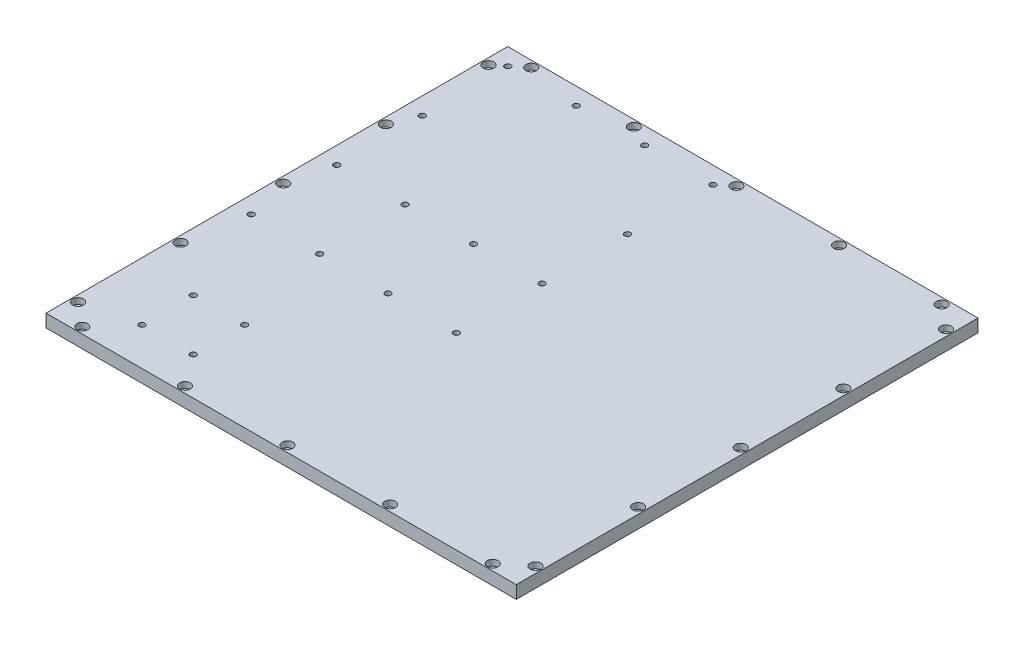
from build123d import *

# Parameters (mm, degrees)
SKETCH1_W                                           = 349.25
SKETCH1_H                                           = 342.9
BOSS_EXTRUDE1_DEPTH                                 = 9.525
CBORE_FOR_8_BINDING_HEAD_MACHINE_SCREW1_D           = 4.3053
CBORE_FOR_8_BINDING_HEAD_MACHINE_SCREW1_CBORE_D     = 7.9375
CBORE_FOR_8_BINDING_HEAD_MACHINE_SCREW1_CBORE_DEPTH = 4.4196
SKETCH5_R                                           = 2.1971
CUT_EXTRUDE1_DEPTH                                  = 245.907571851
SKETCH6_R                                           = 2.1971
CUT_EXTRUDE2_DEPTH                                  = 245.907571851


with BuildPart() as part:
    # Sketch1 → Boss-Extrude1 (new body)
    with BuildSketch(Plane(origin=(0, 0, 0), x_dir=(1, 0, 0), z_dir=(0, 1, 0))):
        Rectangle(SKETCH1_W, SKETCH1_H)
    extrude(amount=BOSS_EXTRUDE1_DEPTH)

    # CBORE for _8 Binding Head Machine Screw1 (through all)
    with Locations(Plane(origin=(0, 9.525, 0), x_dir=(1, 0, 0), z_dir=(0, 1, 0))):
        with Locations((-152.4, 166.6875), (-169.8625, 152.4), (-169.8625, 76.2), (-169.8625, 0), (-169.8625, -76.2), (-169.8625, -152.4), (-152.4, -166.6875), (-76.2, -166.6875), (0, -166.6875), (-76.2, 166.6875), (0, 166.6875), (76.2, 166.6875), (152.4, 166.6875), (169.8625, 152.4), (169.8625, 76.2), (169.8625, 0), (169.8625, -76.2), (169.8625, -152.4), (76.2, -166.6875), (152.4, -166.6875)):
            CounterBoreHole(CBORE_FOR_8_BINDING_HEAD_MACHINE_SCREW1_D / 2, CBORE_FOR_8_BINDING_HEAD_MACHINE_SCREW1_CBORE_D / 2, CBORE_FOR_8_BINDING_HEAD_MACHINE_SCREW1_CBORE_DEPTH)

    # Sketch5 → Cut-Extrude1 (cut, through all)
    with BuildSketch(Plane(origin=(0, 9.525, 0), x_dir=(1, 0, 0), z_dir=(0, 1, 0))):
        with Locations(Location((-9.525, 158.75, 0), (0, 0, 270))):
            Circle(SKETCH5_R)
        with Locations(Location((-60.325, 158.75, 0), (0, 0, 270))):
            Circle(SKETCH5_R)
        with Locations(Location((-111.125, 158.75, 0), (0, 0, 270))):
            Circle(SKETCH5_R)
        with Locations(Location((-161.925, 158.75, 0), (0, 0, 270))):
            Circle(SKETCH5_R)
        with Locations(Location((-9.525, 95.25, 0), (0, 0, 270))):
            Circle(SKETCH5_R)
        with Locations(Location((-161.925, 95.25, 0), (0, 0, 270))):
            Circle(SKETCH5_R)
        with Locations(Location((-161.925, 31.75, 0), (0, 0, 270))):
            Circle(SKETCH5_R)
        with Locations(Location((-111.125, 31.75, 0), (0, 0, 270))):
            Circle(SKETCH5_R)
        with Locations(Location((-60.325, 31.75, 0), (0, 0, 270))):
            Circle(SKETCH5_R)
        with Locations(Location((-9.525, 31.75, 0), (0, 0, 270))):
            Circle(SKETCH5_R)
        with Locations(Location((-161.925, -31.75, 0), (0, 0, 270))):
            Circle(SKETCH5_R)
        with Locations(Location((-111.125, -31.75, 0), (0, 0, 270))):
            Circle(SKETCH5_R)
        with Locations(Location((-60.325, -31.75, 0), (0, 0, 270))):
            Circle(SKETCH5_R)
        with Locations(Location((-9.525, -31.75, 0), (0, 0, 270))):
            Circle(SKETCH5_R)
    extrude(amount=-CUT_EXTRUDE1_DEPTH, mode=Mode.SUBTRACT)

    # Sketch6 → Cut-Extrude2 (cut, through all)
    with BuildSketch(Plane(origin=(0, 9.525, 0), x_dir=(1, 0, 0), z_dir=(0, 1, 0))):
        with Locations(Location((-93.353010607, -105.272057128, 0), (0, 0, 270))):
            Circle(SKETCH6_R)
        with Locations(Location((-93.353010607, -143.372057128, 0), (0, 0, 270))):
            Circle(SKETCH6_R)
        with Locations(Location((-131.453010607, -105.272057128, 0), (0, 0, 270))):
            Circle(SKETCH6_R)
        with Locations(Location((-131.453010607, -143.372057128, 0), (0, 0, 270))):
            Circle(SKETCH6_R)
    extrude(amount=-CUT_EXTRUDE2_DEPTH, mode=Mode.SUBTRACT)


solid = part.part
